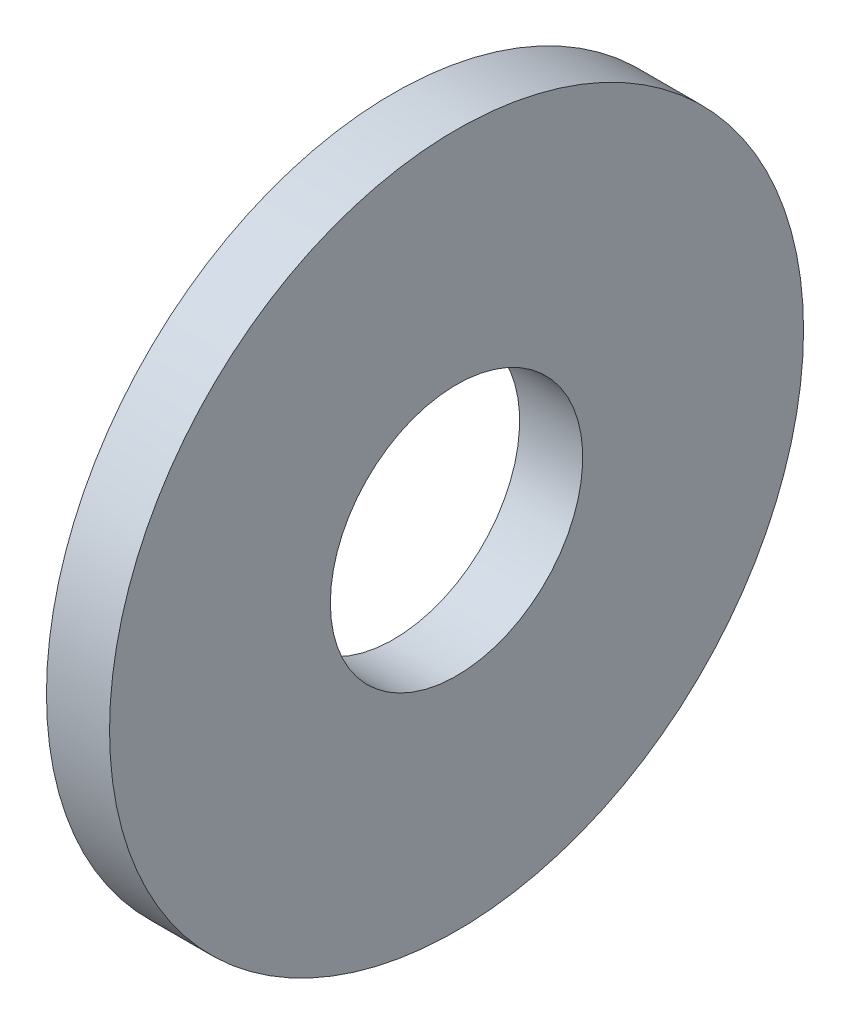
ISO-10303-21;
HEADER;
FILE_DESCRIPTION(('STEP AP214'),'2;1');
FILE_NAME('part.step','',(''),(''),'','','');
FILE_SCHEMA(('AUTOMOTIVE_DESIGN { 1 0 10303 214 1 1 1 1 }'));
ENDSEC;
DATA;
#1=APPLICATION_CONTEXT('core data for automotive mechanical design processes');
#2=APPLICATION_PROTOCOL_DEFINITION('international standard','automotive_design',2000,#1);
#3=PRODUCT_CONTEXT('',#1,'mechanical');
#4=PRODUCT('Part','Part','',(#3));
#5=PRODUCT_RELATED_PRODUCT_CATEGORY('part','',(#4));
#6=PRODUCT_DEFINITION_FORMATION('','',#4);
#7=PRODUCT_DEFINITION_CONTEXT('part definition',#1,'design');
#8=PRODUCT_DEFINITION('design','',#6,#7);
#9=PRODUCT_DEFINITION_SHAPE('','',#8);
#10=(LENGTH_UNIT() NAMED_UNIT(*) SI_UNIT(.MILLI.,.METRE.));
#11=(NAMED_UNIT(*) PLANE_ANGLE_UNIT() SI_UNIT($,.RADIAN.));
#12=(NAMED_UNIT(*) SI_UNIT($,.STERADIAN.) SOLID_ANGLE_UNIT());
#13=UNCERTAINTY_MEASURE_WITH_UNIT(LENGTH_MEASURE(1.E-05),#10,'distance_accuracy_value','');
#14=(GEOMETRIC_REPRESENTATION_CONTEXT(3) GLOBAL_UNCERTAINTY_ASSIGNED_CONTEXT((#13)) GLOBAL_UNIT_ASSIGNED_CONTEXT((#10,
#11,#12)) REPRESENTATION_CONTEXT('',''));
#15=CARTESIAN_POINT('',(0.,0.,0.));
#16=DIRECTION('',(0.,0.,1.));
#17=DIRECTION('',(1.,0.,0.));
#18=AXIS2_PLACEMENT_3D('',#15,#16,#17);
#19=CARTESIAN_POINT('',(-20.0870778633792,0.,0.));
#20=DIRECTION('',(-1.,0.,0.));
#21=DIRECTION('',(0.,0.,1.));
#22=AXIS2_PLACEMENT_3D('',#19,#20,#21);
#23=CYLINDRICAL_SURFACE('',#22,10.);
#24=CARTESIAN_POINT('',(0.,0.,0.));
#25=DIRECTION('',(-1.,0.,0.));
#26=DIRECTION('',(0.,0.,1.));
#27=AXIS2_PLACEMENT_3D('',#24,#25,#26);
#28=CIRCLE('',#27,10.);
#29=CARTESIAN_POINT('',(0.,0.,10.));
#30=VERTEX_POINT('',#29);
#31=EDGE_CURVE('E10',#30,#30,#28,.T.);
#32=ORIENTED_EDGE('',*,*,#31,.F.);
#33=EDGE_LOOP('',(#32));
#34=FACE_BOUND('',#33,.T.);
#35=CARTESIAN_POINT('',(-5.,0.,0.));
#36=DIRECTION('',(-1.,0.,0.));
#37=DIRECTION('',(0.,0.,1.));
#38=AXIS2_PLACEMENT_3D('',#35,#36,#37);
#39=CIRCLE('',#38,10.);
#40=CARTESIAN_POINT('',(-5.,0.,10.));
#41=VERTEX_POINT('',#40);
#42=EDGE_CURVE('E59',#41,#41,#39,.T.);
#43=ORIENTED_EDGE('',*,*,#42,.T.);
#44=EDGE_LOOP('',(#43));
#45=FACE_BOUND('',#44,.T.);
#46=ADVANCED_FACE('F31',(#34,#45),#23,.F.);
#47=CARTESIAN_POINT('',(0.,10.,0.));
#48=DIRECTION('',(-1.,0.,0.));
#49=DIRECTION('',(0.,0.,1.));
#50=AXIS2_PLACEMENT_3D('',#47,#48,#49);
#51=PLANE('',#50);
#52=CARTESIAN_POINT('',(0.,0.,0.));
#53=DIRECTION('',(-1.,0.,0.));
#54=DIRECTION('',(0.,0.,1.));
#55=AXIS2_PLACEMENT_3D('',#52,#53,#54);
#56=CIRCLE('',#55,27.5);
#57=CARTESIAN_POINT('',(0.,0.,27.5));
#58=VERTEX_POINT('',#57);
#59=EDGE_CURVE('E37',#58,#58,#56,.T.);
#60=ORIENTED_EDGE('',*,*,#59,.F.);
#61=EDGE_LOOP('',(#60));
#62=FACE_BOUND('',#61,.T.);
#63=ORIENTED_EDGE('',*,*,#31,.T.);
#64=EDGE_LOOP('',(#63));
#65=FACE_BOUND('',#64,.T.);
#66=ADVANCED_FACE('F96',(#62,#65),#51,.F.);
#67=CARTESIAN_POINT('',(-20.0870778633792,0.,0.));
#68=DIRECTION('',(-1.,0.,0.));
#69=DIRECTION('',(0.,0.,1.));
#70=AXIS2_PLACEMENT_3D('',#67,#68,#69);
#71=CYLINDRICAL_SURFACE('',#70,27.5);
#72=CARTESIAN_POINT('',(-5.,0.,0.));
#73=DIRECTION('',(-1.,0.,0.));
#74=DIRECTION('',(0.,0.,1.));
#75=AXIS2_PLACEMENT_3D('',#72,#73,#74);
#76=CIRCLE('',#75,27.5);
#77=CARTESIAN_POINT('',(-5.,0.,27.5));
#78=VERTEX_POINT('',#77);
#79=EDGE_CURVE('E41',#78,#78,#76,.T.);
#80=ORIENTED_EDGE('',*,*,#79,.F.);
#81=EDGE_LOOP('',(#80));
#82=FACE_BOUND('',#81,.T.);
#83=ORIENTED_EDGE('',*,*,#59,.T.);
#84=EDGE_LOOP('',(#83));
#85=FACE_BOUND('',#84,.T.);
#86=ADVANCED_FACE('F91',(#82,#85),#71,.T.);
#87=CARTESIAN_POINT('',(-5.,27.5,0.));
#88=DIRECTION('',(1.,0.,0.));
#89=DIRECTION('',(0.,0.,-1.));
#90=AXIS2_PLACEMENT_3D('',#87,#88,#89);
#91=PLANE('',#90);
#92=CARTESIAN_POINT('',(-5.,0.,0.));
#93=DIRECTION('',(-1.,0.,0.));
#94=DIRECTION('',(0.,0.,1.));
#95=AXIS2_PLACEMENT_3D('',#92,#93,#94);
#96=CIRCLE('',#95,22.5);
#97=CARTESIAN_POINT('',(-5.,0.,22.5));
#98=VERTEX_POINT('',#97);
#99=EDGE_CURVE('E45',#98,#98,#96,.T.);
#100=ORIENTED_EDGE('',*,*,#99,.F.);
#101=EDGE_LOOP('',(#100));
#102=FACE_BOUND('',#101,.T.);
#103=ORIENTED_EDGE('',*,*,#79,.T.);
#104=EDGE_LOOP('',(#103));
#105=FACE_BOUND('',#104,.T.);
#106=ADVANCED_FACE('F85',(#102,#105),#91,.F.);
#107=CARTESIAN_POINT('',(-5.,0.,0.));
#108=DIRECTION('',(-1.,0.,0.));
#109=DIRECTION('',(0.,0.,1.));
#110=AXIS2_PLACEMENT_3D('',#107,#108,#109);
#111=CONICAL_SURFACE('',#110,22.5,0.321750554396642);
#112=CARTESIAN_POINT('',(-2.,0.,0.));
#113=DIRECTION('',(-1.,0.,0.));
#114=DIRECTION('',(0.,0.,1.));
#115=AXIS2_PLACEMENT_3D('',#112,#113,#114);
#116=CIRCLE('',#115,21.5);
#117=CARTESIAN_POINT('',(-2.,0.,21.5));
#118=VERTEX_POINT('',#117);
#119=EDGE_CURVE('E50',#118,#118,#116,.T.);
#120=ORIENTED_EDGE('',*,*,#119,.F.);
#121=EDGE_LOOP('',(#120));
#122=FACE_BOUND('',#121,.T.);
#123=ORIENTED_EDGE('',*,*,#99,.T.);
#124=EDGE_LOOP('',(#123));
#125=FACE_BOUND('',#124,.T.);
#126=ADVANCED_FACE('F79',(#122,#125),#111,.F.);
#127=CARTESIAN_POINT('',(-2.,21.5,0.));
#128=DIRECTION('',(1.,0.,0.));
#129=DIRECTION('',(0.,0.,-1.));
#130=AXIS2_PLACEMENT_3D('',#127,#128,#129);
#131=PLANE('',#130);
#132=CARTESIAN_POINT('',(-2.,0.,0.));
#133=DIRECTION('',(-1.,0.,0.));
#134=DIRECTION('',(0.,0.,1.));
#135=AXIS2_PLACEMENT_3D('',#132,#133,#134);
#136=CIRCLE('',#135,15.5);
#137=CARTESIAN_POINT('',(-2.,0.,15.5));
#138=VERTEX_POINT('',#137);
#139=EDGE_CURVE('E53',#138,#138,#136,.T.);
#140=ORIENTED_EDGE('',*,*,#139,.F.);
#141=EDGE_LOOP('',(#140));
#142=FACE_BOUND('',#141,.T.);
#143=ORIENTED_EDGE('',*,*,#119,.T.);
#144=EDGE_LOOP('',(#143));
#145=FACE_BOUND('',#144,.T.);
#146=ADVANCED_FACE('F73',(#142,#145),#131,.F.);
#147=CARTESIAN_POINT('',(-2.,0.,0.));
#148=DIRECTION('',(1.,0.,0.));
#149=DIRECTION('',(0.,0.,-1.));
#150=AXIS2_PLACEMENT_3D('',#147,#148,#149);
#151=CONICAL_SURFACE('',#150,15.5,0.463647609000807);
#152=CARTESIAN_POINT('',(-5.,0.,0.));
#153=DIRECTION('',(-1.,0.,0.));
#154=DIRECTION('',(0.,0.,1.));
#155=AXIS2_PLACEMENT_3D('',#152,#153,#154);
#156=CIRCLE('',#155,14.);
#157=CARTESIAN_POINT('',(-5.,0.,14.));
#158=VERTEX_POINT('',#157);
#159=EDGE_CURVE('E56',#158,#158,#156,.T.);
#160=ORIENTED_EDGE('',*,*,#159,.F.);
#161=EDGE_LOOP('',(#160));
#162=FACE_BOUND('',#161,.T.);
#163=ORIENTED_EDGE('',*,*,#139,.T.);
#164=EDGE_LOOP('',(#163));
#165=FACE_BOUND('',#164,.T.);
#166=ADVANCED_FACE('F67',(#162,#165),#151,.T.);
#167=CARTESIAN_POINT('',(-5.,14.,0.));
#168=DIRECTION('',(1.,0.,0.));
#169=DIRECTION('',(0.,0.,-1.));
#170=AXIS2_PLACEMENT_3D('',#167,#168,#169);
#171=PLANE('',#170);
#172=ORIENTED_EDGE('',*,*,#42,.F.);
#173=EDGE_LOOP('',(#172));
#174=FACE_BOUND('',#173,.T.);
#175=ORIENTED_EDGE('',*,*,#159,.T.);
#176=EDGE_LOOP('',(#175));
#177=FACE_BOUND('',#176,.T.);
#178=ADVANCED_FACE('F64',(#174,#177),#171,.F.);
#179=CLOSED_SHELL('',(#46,#66,#86,#106,#126,#146,#166,#178));
#180=MANIFOLD_SOLID_BREP('B2',#179);
#181=ADVANCED_BREP_SHAPE_REPRESENTATION('',(#18,#180),#14);
#182=SHAPE_DEFINITION_REPRESENTATION(#9,#181);
ENDSEC;
END-ISO-10303-21;
